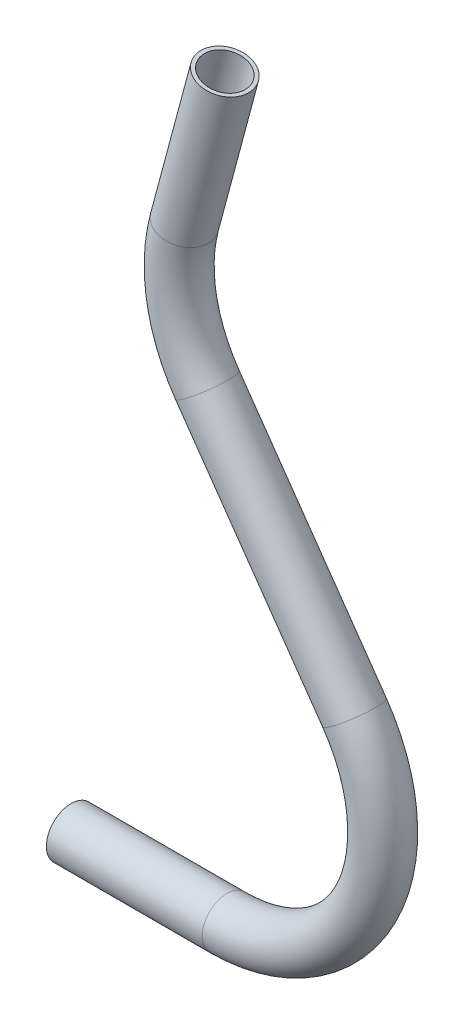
from build123d import *

# Parameters (mm, degrees)
ESQUISSE2_R   = 13.5
ESQUISSE2_R_2 = 11.5


with BuildPart() as part:
    # Balayage1: sweep along a path in Esquisse1
    with BuildLine(Plane.XY) as balayage1_path:
        Line((0, 0), (85, 0))
        ThreePointArc((85, 0), (160.39592082, 45.751367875), (154.627923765, 133.75399709))
        Line((154.627923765, 133.75399709), (74.327222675, 248.43528329))
        ThreePointArc((74.327222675, 248.43528329), (60.246487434, 282.429185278), (61.851451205, 319.188899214))
        Line((61.851451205, 319.188899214), (83.851070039, 401.292594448))
    # Esquisse2 → Balayage1 (sweep)
    with BuildSketch(Plane(origin=(0, 0, 0), x_dir=(0, 0, -1), z_dir=(1, 0, 0))):
        Circle(ESQUISSE2_R)
        Circle(ESQUISSE2_R_2, mode=Mode.SUBTRACT)
    sweep(path=balayage1_path.line)


solid = part.part
